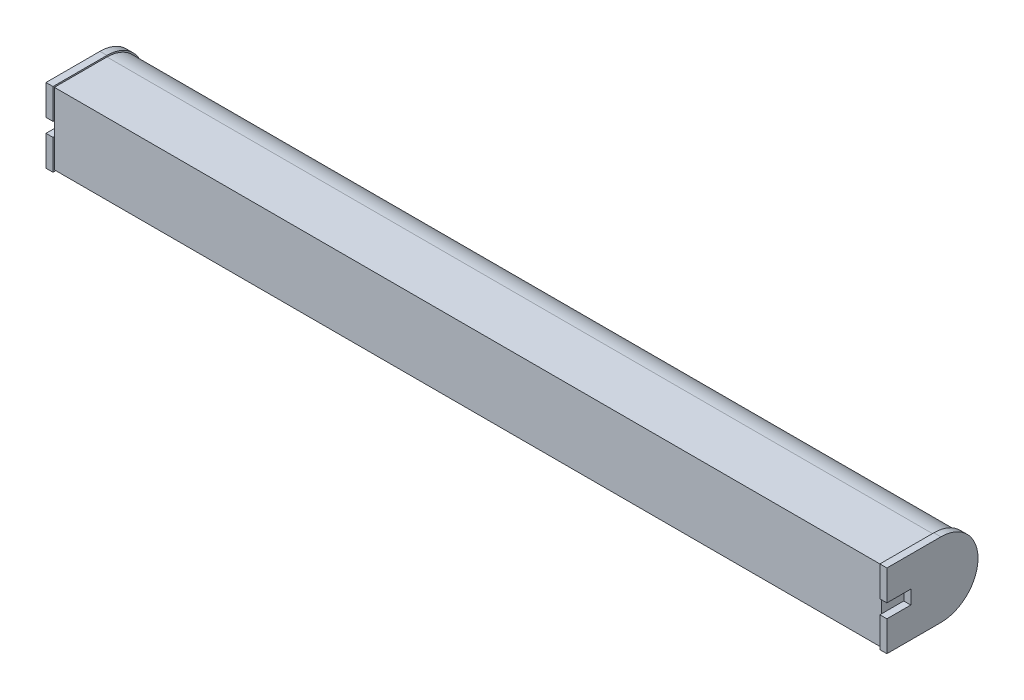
from build123d import *

# Parameters (mm, degrees)
SALIENTE_EXTRUIR1_DEPTH = 5
SALIENTE_EXTRUIR2_DEPTH = 590


with BuildPart() as part:
    # Croquis1 → Saliente-Extruir1 (new body)
    with BuildSketch(Plane(origin=(0, 0, 0), x_dir=(0, 0, -1), z_dir=(1, 0, 0))):
        with BuildLine():
            Line((-25.731884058, 4.919723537), (-25.731884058, 26.5))
            Line((-25.731884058, 26.5), (12.768115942, 26.5))
            ThreePointArc((12.768115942, 26.5), (39.268115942, 0), (12.768115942, -26.5))
            Line((12.768115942, -26.5), (-25.731884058, -26.5))
            Line((-25.731884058, -26.5), (-25.731884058, -4.919723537))
            Line((-25.731884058, -4.919723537), (-8.698946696, -4.919723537))
            Line((-8.698946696, -4.919723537), (-8.698946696, 4.919723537))
            Line((-8.698946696, 4.919723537), (-25.731884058, 4.919723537))
        make_face()
    saliente_extruir1 = extrude(amount=SALIENTE_EXTRUIR1_DEPTH)

    # Croquis2 → Saliente-Extruir2 (add)
    with BuildSketch(Plane(origin=(5, 0, 0), x_dir=(0, 0, -1), z_dir=(1, 0, 0))):
        with BuildLine():
            Line((-24.731884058, 5.919723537), (-24.731884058, -5.919723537))
            Line((-24.731884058, -5.919723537), (-24.731884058, -25.5))
            Line((-24.731884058, -25.5), (12.768115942, -25.5))
            ThreePointArc((12.768115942, -25.5), (38.268115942, 0), (12.768115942, 25.5))
            Line((12.768115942, 25.5), (-24.731884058, 25.5))
            Line((-24.731884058, 25.5), (-24.731884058, 5.919723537))
        make_face()
    extrude(amount=SALIENTE_EXTRUIR2_DEPTH)

    # Simetr_a1: Saliente-Extruir1 across plane
    add(saliente_extruir1.mirror(Plane(origin=(300, 0, 0), x_dir=(0, 0, 1), z_dir=(1, 0, 0))))


solid = part.part
